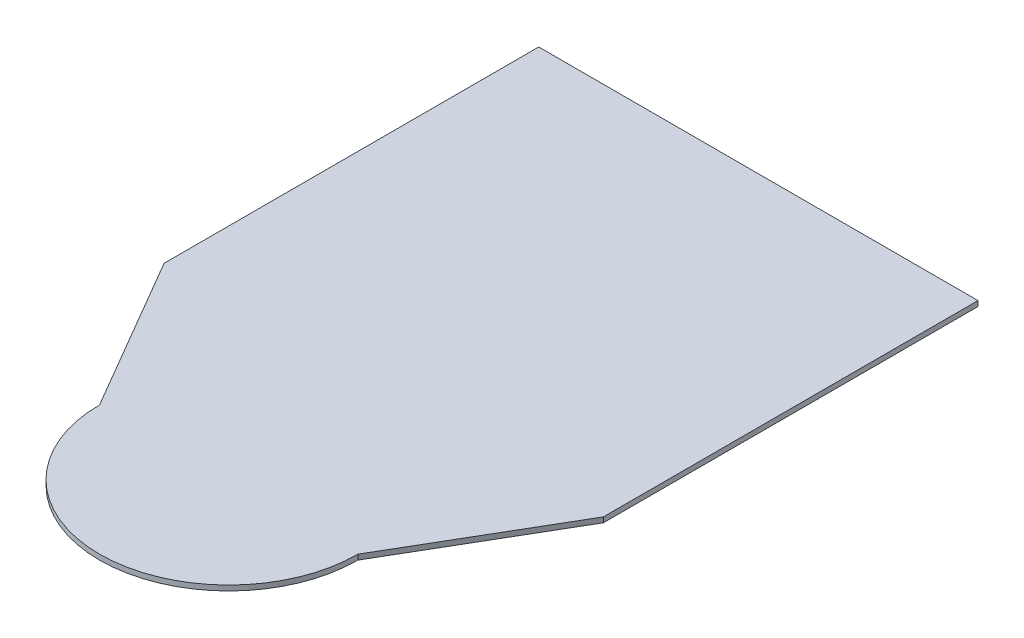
ISO-10303-21;
HEADER;
FILE_DESCRIPTION(('STEP AP214'),'2;1');
FILE_NAME('part.step','',(''),(''),'','','');
FILE_SCHEMA(('AUTOMOTIVE_DESIGN { 1 0 10303 214 1 1 1 1 }'));
ENDSEC;
DATA;
#1=APPLICATION_CONTEXT('core data for automotive mechanical design processes');
#2=APPLICATION_PROTOCOL_DEFINITION('international standard','automotive_design',2000,#1);
#3=PRODUCT_CONTEXT('',#1,'mechanical');
#4=PRODUCT('Part','Part','',(#3));
#5=PRODUCT_RELATED_PRODUCT_CATEGORY('part','',(#4));
#6=PRODUCT_DEFINITION_FORMATION('','',#4);
#7=PRODUCT_DEFINITION_CONTEXT('part definition',#1,'design');
#8=PRODUCT_DEFINITION('design','',#6,#7);
#9=PRODUCT_DEFINITION_SHAPE('','',#8);
#10=(LENGTH_UNIT() NAMED_UNIT(*) SI_UNIT(.MILLI.,.METRE.));
#11=(NAMED_UNIT(*) PLANE_ANGLE_UNIT() SI_UNIT($,.RADIAN.));
#12=(NAMED_UNIT(*) SI_UNIT($,.STERADIAN.) SOLID_ANGLE_UNIT());
#13=UNCERTAINTY_MEASURE_WITH_UNIT(LENGTH_MEASURE(1.E-05),#10,'distance_accuracy_value','');
#14=(GEOMETRIC_REPRESENTATION_CONTEXT(3) GLOBAL_UNCERTAINTY_ASSIGNED_CONTEXT((#13)) GLOBAL_UNIT_ASSIGNED_CONTEXT((#10,
#11,#12)) REPRESENTATION_CONTEXT('',''));
#15=CARTESIAN_POINT('',(0.,0.,0.));
#16=DIRECTION('',(0.,0.,1.));
#17=DIRECTION('',(1.,0.,0.));
#18=AXIS2_PLACEMENT_3D('',#15,#16,#17);
#19=CARTESIAN_POINT('',(-85.,-2.,72.5));
#20=DIRECTION('',(-1.,0.,0.));
#21=DIRECTION('',(0.,0.,1.));
#22=AXIS2_PLACEMENT_3D('',#19,#20,#21);
#23=PLANE('',#22);
#24=DIRECTION('',(0.,0.,1.));
#25=VECTOR('',#24,1.);
#26=CARTESIAN_POINT('',(-85.,0.,72.5));
#27=LINE('',#26,#25);
#28=CARTESIAN_POINT('',(-85.,0.,-72.5));
#29=VERTEX_POINT('',#28);
#30=CARTESIAN_POINT('',(-85.,0.,72.5));
#31=VERTEX_POINT('',#30);
#32=EDGE_CURVE('E136',#29,#31,#27,.T.);
#33=ORIENTED_EDGE('',*,*,#32,.F.);
#34=DIRECTION('',(0.,1.,0.));
#35=VECTOR('',#34,1.);
#36=CARTESIAN_POINT('',(-85.,-2.,-72.5));
#37=LINE('',#36,#35);
#38=CARTESIAN_POINT('',(-85.,-2.,-72.5));
#39=VERTEX_POINT('',#38);
#40=EDGE_CURVE('E11',#39,#29,#37,.T.);
#41=ORIENTED_EDGE('',*,*,#40,.F.);
#42=DIRECTION('',(0.,0.,1.));
#43=VECTOR('',#42,1.);
#44=CARTESIAN_POINT('',(-85.,-2.,72.5));
#45=LINE('',#44,#43);
#46=CARTESIAN_POINT('',(-85.,-2.,72.5));
#47=VERTEX_POINT('',#46);
#48=EDGE_CURVE('E156',#39,#47,#45,.T.);
#49=ORIENTED_EDGE('',*,*,#48,.T.);
#50=DIRECTION('',(0.,1.,0.));
#51=VECTOR('',#50,1.);
#52=CARTESIAN_POINT('',(-85.,-2.,72.5));
#53=LINE('',#52,#51);
#54=EDGE_CURVE('E48',#47,#31,#53,.T.);
#55=ORIENTED_EDGE('',*,*,#54,.T.);
#56=EDGE_LOOP('',(#33,#41,#49,#55));
#57=FACE_BOUND('',#56,.T.);
#58=ADVANCED_FACE('F45',(#57),#23,.T.);
#59=CARTESIAN_POINT('',(85.,-2.,-72.5));
#60=DIRECTION('',(0.,0.,-1.));
#61=DIRECTION('',(-1.,0.,0.));
#62=AXIS2_PLACEMENT_3D('',#59,#60,#61);
#63=PLANE('',#62);
#64=DIRECTION('',(-1.,0.,0.));
#65=VECTOR('',#64,1.);
#66=CARTESIAN_POINT('',(85.,0.,-72.5));
#67=LINE('',#66,#65);
#68=CARTESIAN_POINT('',(85.,0.,-72.5));
#69=VERTEX_POINT('',#68);
#70=EDGE_CURVE('E153',#69,#29,#67,.T.);
#71=ORIENTED_EDGE('',*,*,#70,.F.);
#72=DIRECTION('',(0.,1.,0.));
#73=VECTOR('',#72,1.);
#74=CARTESIAN_POINT('',(85.,-2.,-72.5));
#75=LINE('',#74,#73);
#76=CARTESIAN_POINT('',(85.,-2.,-72.5));
#77=VERTEX_POINT('',#76);
#78=EDGE_CURVE('E55',#77,#69,#75,.T.);
#79=ORIENTED_EDGE('',*,*,#78,.F.);
#80=DIRECTION('',(-1.,0.,0.));
#81=VECTOR('',#80,1.);
#82=CARTESIAN_POINT('',(85.,-2.,-72.5));
#83=LINE('',#82,#81);
#84=EDGE_CURVE('E122',#77,#39,#83,.T.);
#85=ORIENTED_EDGE('',*,*,#84,.T.);
#86=ORIENTED_EDGE('',*,*,#40,.T.);
#87=EDGE_LOOP('',(#71,#79,#85,#86));
#88=FACE_BOUND('',#87,.T.);
#89=ADVANCED_FACE('F168',(#88),#63,.T.);
#90=CARTESIAN_POINT('',(85.,-2.,72.5));
#91=DIRECTION('',(1.,0.,0.));
#92=DIRECTION('',(0.,0.,-1.));
#93=AXIS2_PLACEMENT_3D('',#90,#91,#92);
#94=PLANE('',#93);
#95=DIRECTION('',(0.,0.,-1.));
#96=VECTOR('',#95,1.);
#97=CARTESIAN_POINT('',(85.,0.,72.5));
#98=LINE('',#97,#96);
#99=CARTESIAN_POINT('',(85.,0.,72.5));
#100=VERTEX_POINT('',#99);
#101=EDGE_CURVE('E108',#100,#69,#98,.T.);
#102=ORIENTED_EDGE('',*,*,#101,.F.);
#103=DIRECTION('',(0.,1.,0.));
#104=VECTOR('',#103,1.);
#105=CARTESIAN_POINT('',(85.,-2.,72.5));
#106=LINE('',#105,#104);
#107=CARTESIAN_POINT('',(85.,-2.,72.5));
#108=VERTEX_POINT('',#107);
#109=EDGE_CURVE('E103',#108,#100,#106,.T.);
#110=ORIENTED_EDGE('',*,*,#109,.F.);
#111=DIRECTION('',(0.,0.,-1.));
#112=VECTOR('',#111,1.);
#113=CARTESIAN_POINT('',(85.,-2.,72.5));
#114=LINE('',#113,#112);
#115=EDGE_CURVE('E106',#108,#77,#114,.T.);
#116=ORIENTED_EDGE('',*,*,#115,.T.);
#117=ORIENTED_EDGE('',*,*,#78,.T.);
#118=EDGE_LOOP('',(#102,#110,#116,#117));
#119=FACE_BOUND('',#118,.T.);
#120=ADVANCED_FACE('F105',(#119),#94,.T.);
#121=CARTESIAN_POINT('',(85.,-2.,72.5));
#122=DIRECTION('',(0.863778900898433,0.,0.503871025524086));
#123=DIRECTION('',(0.503871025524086,0.,-0.863778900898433));
#124=AXIS2_PLACEMENT_3D('',#121,#122,#123);
#125=PLANE('',#124);
#126=DIRECTION('',(0.503871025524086,0.,-0.863778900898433));
#127=VECTOR('',#126,1.);
#128=CARTESIAN_POINT('',(85.,0.,72.5));
#129=LINE('',#128,#127);
#130=CARTESIAN_POINT('',(50.,0.,132.5));
#131=VERTEX_POINT('',#130);
#132=EDGE_CURVE('E148',#131,#100,#129,.T.);
#133=ORIENTED_EDGE('',*,*,#132,.F.);
#134=DIRECTION('',(0.,1.,0.));
#135=VECTOR('',#134,1.);
#136=CARTESIAN_POINT('',(50.,-2.,132.5));
#137=LINE('',#136,#135);
#138=CARTESIAN_POINT('',(50.,-2.,132.5));
#139=VERTEX_POINT('',#138);
#140=EDGE_CURVE('E114',#139,#131,#137,.T.);
#141=ORIENTED_EDGE('',*,*,#140,.F.);
#142=DIRECTION('',(0.503871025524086,0.,-0.863778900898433));
#143=VECTOR('',#142,1.);
#144=CARTESIAN_POINT('',(85.,-2.,72.5));
#145=LINE('',#144,#143);
#146=EDGE_CURVE('E120',#139,#108,#145,.T.);
#147=ORIENTED_EDGE('',*,*,#146,.T.);
#148=ORIENTED_EDGE('',*,*,#109,.T.);
#149=EDGE_LOOP('',(#133,#141,#147,#148));
#150=FACE_BOUND('',#149,.T.);
#151=ADVANCED_FACE('F125',(#150),#125,.T.);
#152=CARTESIAN_POINT('',(0.,-2.,132.5));
#153=DIRECTION('',(0.,1.,0.));
#154=DIRECTION('',(0.,0.,1.));
#155=AXIS2_PLACEMENT_3D('',#152,#153,#154);
#156=CYLINDRICAL_SURFACE('',#155,50.);
#157=CARTESIAN_POINT('',(0.,0.,132.5));
#158=DIRECTION('',(0.,1.,0.));
#159=DIRECTION('',(0.,0.,1.));
#160=AXIS2_PLACEMENT_3D('',#157,#158,#159);
#161=CIRCLE('',#160,50.);
#162=CARTESIAN_POINT('',(-50.,0.,132.5));
#163=VERTEX_POINT('',#162);
#164=EDGE_CURVE('E144',#163,#131,#161,.T.);
#165=ORIENTED_EDGE('',*,*,#164,.F.);
#166=DIRECTION('',(0.,1.,0.));
#167=VECTOR('',#166,1.);
#168=CARTESIAN_POINT('',(-50.,-2.,132.5));
#169=LINE('',#168,#167);
#170=CARTESIAN_POINT('',(-50.,-2.,132.5));
#171=VERTEX_POINT('',#170);
#172=EDGE_CURVE('E161',#171,#163,#169,.T.);
#173=ORIENTED_EDGE('',*,*,#172,.F.);
#174=CARTESIAN_POINT('',(0.,-2.,132.5));
#175=DIRECTION('',(0.,1.,0.));
#176=DIRECTION('',(0.,0.,1.));
#177=AXIS2_PLACEMENT_3D('',#174,#175,#176);
#178=CIRCLE('',#177,50.);
#179=EDGE_CURVE('E127',#171,#139,#178,.T.);
#180=ORIENTED_EDGE('',*,*,#179,.T.);
#181=ORIENTED_EDGE('',*,*,#140,.T.);
#182=EDGE_LOOP('',(#165,#173,#180,#181));
#183=FACE_BOUND('',#182,.T.);
#184=ADVANCED_FACE('F181',(#183),#156,.T.);
#185=CARTESIAN_POINT('',(-85.,-2.,72.5));
#186=DIRECTION('',(-0.863778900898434,0.,0.503871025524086));
#187=DIRECTION('',(0.503871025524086,0.,0.863778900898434));
#188=AXIS2_PLACEMENT_3D('',#185,#186,#187);
#189=PLANE('',#188);
#190=DIRECTION('',(0.503871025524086,0.,0.863778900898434));
#191=VECTOR('',#190,1.);
#192=CARTESIAN_POINT('',(-85.,0.,72.5));
#193=LINE('',#192,#191);
#194=EDGE_CURVE('E140',#31,#163,#193,.T.);
#195=ORIENTED_EDGE('',*,*,#194,.F.);
#196=ORIENTED_EDGE('',*,*,#54,.F.);
#197=DIRECTION('',(0.503871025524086,0.,0.863778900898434));
#198=VECTOR('',#197,1.);
#199=CARTESIAN_POINT('',(-85.,-2.,72.5));
#200=LINE('',#199,#198);
#201=EDGE_CURVE('E130',#47,#171,#200,.T.);
#202=ORIENTED_EDGE('',*,*,#201,.T.);
#203=ORIENTED_EDGE('',*,*,#172,.T.);
#204=EDGE_LOOP('',(#195,#196,#202,#203));
#205=FACE_BOUND('',#204,.T.);
#206=ADVANCED_FACE('F165',(#205),#189,.T.);
#207=CARTESIAN_POINT('',(0.,-2.,132.5));
#208=DIRECTION('',(0.,1.,0.));
#209=DIRECTION('',(0.,0.,1.));
#210=AXIS2_PLACEMENT_3D('',#207,#208,#209);
#211=PLANE('',#210);
#212=ORIENTED_EDGE('',*,*,#48,.F.);
#213=ORIENTED_EDGE('',*,*,#84,.F.);
#214=ORIENTED_EDGE('',*,*,#115,.F.);
#215=ORIENTED_EDGE('',*,*,#146,.F.);
#216=ORIENTED_EDGE('',*,*,#179,.F.);
#217=ORIENTED_EDGE('',*,*,#201,.F.);
#218=EDGE_LOOP('',(#212,#213,#214,#215,#216,#217));
#219=FACE_BOUND('',#218,.T.);
#220=ADVANCED_FACE('F118',(#219),#211,.F.);
#221=CARTESIAN_POINT('',(0.,0.,132.5));
#222=DIRECTION('',(0.,1.,0.));
#223=DIRECTION('',(0.,0.,1.));
#224=AXIS2_PLACEMENT_3D('',#221,#222,#223);
#225=PLANE('',#224);
#226=ORIENTED_EDGE('',*,*,#32,.T.);
#227=ORIENTED_EDGE('',*,*,#194,.T.);
#228=ORIENTED_EDGE('',*,*,#164,.T.);
#229=ORIENTED_EDGE('',*,*,#132,.T.);
#230=ORIENTED_EDGE('',*,*,#101,.T.);
#231=ORIENTED_EDGE('',*,*,#70,.T.);
#232=EDGE_LOOP('',(#226,#227,#228,#229,#230,#231));
#233=FACE_BOUND('',#232,.T.);
#234=ADVANCED_FACE('F167',(#233),#225,.T.);
#235=CLOSED_SHELL('',(#58,#89,#120,#151,#184,#206,#220,#234));
#236=MANIFOLD_SOLID_BREP('B2',#235);
#237=ADVANCED_BREP_SHAPE_REPRESENTATION('',(#18,#236),#14);
#238=SHAPE_DEFINITION_REPRESENTATION(#9,#237);
ENDSEC;
END-ISO-10303-21;
